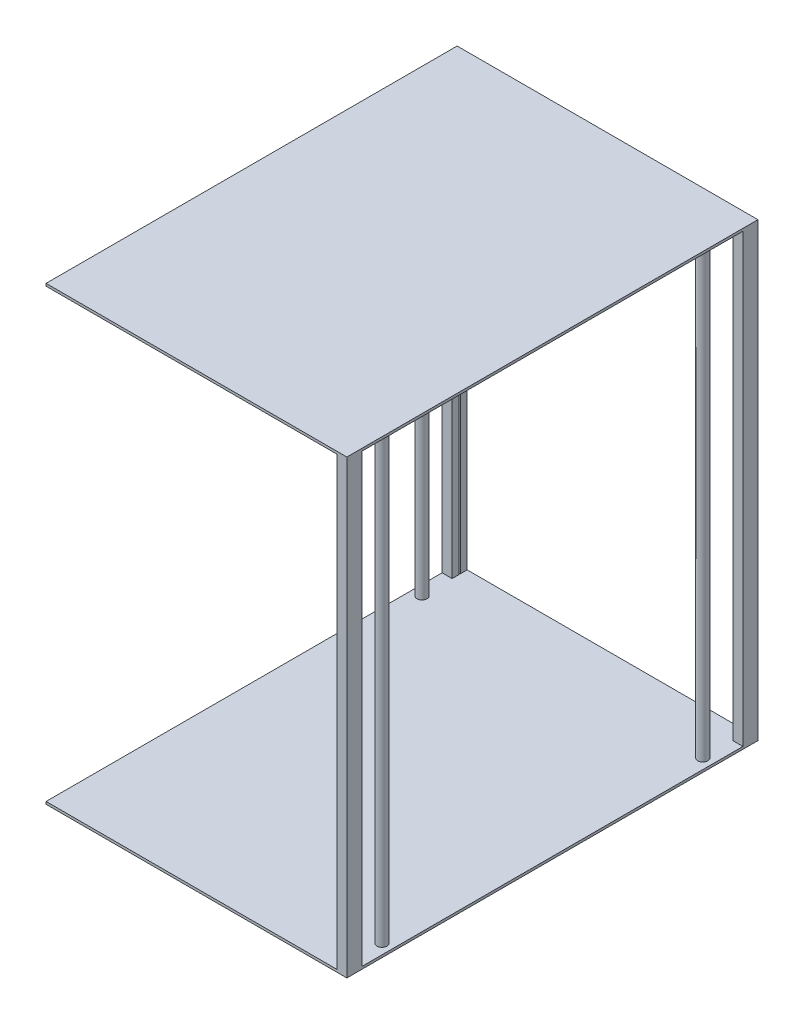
from build123d import *

# Parameters (mm, degrees)
SKETCH1_W           = 1524
SKETCH1_H           = 2082.8
BOSS_EXTRUDE1_DEPTH = 2286
SKETCH2_R           = 25.4
CUT_EXTRUDE2_DEPTH  = 2273.3
SKETCH3_W           = 1524
SKETCH3_H           = 2082.8
BOSS_EXTRUDE2_DEPTH = 12.7


with BuildPart() as part:
    # Sketch1 → Boss-Extrude1 (new body)
    with BuildSketch(Plane(origin=(0, 0, 0), x_dir=(1, 0, 0), z_dir=(0, 1, 0))):
        with Locations((704.608649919, -1011.918142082)):
            Rectangle(SKETCH1_W, SKETCH1_H)
    extrude(amount=BOSS_EXTRUDE1_DEPTH)

    # Sketch2 → Cut-Extrude2 (cut)
    with BuildSketch(Plane(origin=(0, 2286, 0), x_dir=(1, 0, 0), z_dir=(0, 1, 0))):
        Polygon((-57.391350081, -2053.318142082), (1415.808649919, -2053.318142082), (1415.808649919, -1977.118142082), (1466.608649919, -1977.118142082), (1466.608649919, -46.718142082), (1415.808649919, -46.718142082), (1415.808649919, -11.793142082), (1441.208649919, -11.793142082), (1441.208649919, -5.443142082), (1415.808649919, -5.443142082), (1415.808649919, 29.481857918), (-6.591350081, 29.481857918), (-6.591350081, -5.443142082), (-31.991350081, -5.443142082), (-31.991350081, -11.793142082), (-6.591350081, -11.793142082), (-6.591350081, -46.718142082), (-57.391350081, -46.718142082), align=None)
        with Locations(Location((1415.808649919, -1824.718142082, 0), (0, 0, 270))):
            Circle(SKETCH2_R, mode=Mode.SUBTRACT)
        with Locations(Location((1415.808649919, -199.118142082, 0), (0, 0, 270))):
            Circle(SKETCH2_R, mode=Mode.SUBTRACT)
        with Locations(Location((-6.591350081, -199.118142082, 0), (0, 0, 270))):
            Circle(SKETCH2_R, mode=Mode.SUBTRACT)
    extrude(amount=-CUT_EXTRUDE2_DEPTH, mode=Mode.SUBTRACT)

    # Sketch3 → Boss-Extrude2 (add)
    with BuildSketch(Plane(origin=(0, 2286, 0), x_dir=(1, 0, 0), z_dir=(0, 1, 0))):
        with Locations((704.608649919, -1011.918142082)):
            Rectangle(SKETCH3_W, SKETCH3_H)
    extrude(amount=-BOSS_EXTRUDE2_DEPTH)


solid = part.part
